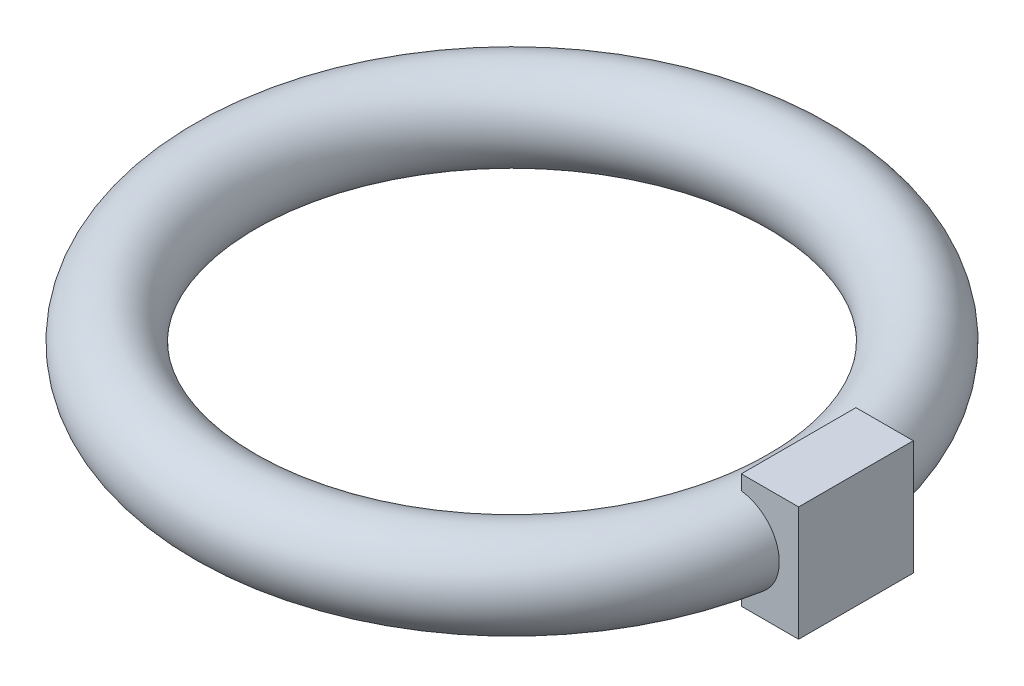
from build123d import *

# Parameters (mm, degrees)
SKETCH1_R           = 7.5
SKETCH4_W           = 20
SKETCH4_H           = 20
BOSS_EXTRUDE1_DEPTH = 10


with BuildPart() as part:
    # Base-Sweep: sweep along a path in Sketch2
    with BuildLine(Plane(origin=(0, 0, 0), x_dir=(1, 0, 0), z_dir=(0, 1, 0))) as base_sweep_path:
        CenterArc((50, 0), 40, 0, 360)
    # Sketch1 → Base-Sweep (sweep)
    with BuildSketch(Plane.XY):
        Circle(SKETCH1_R)
    sweep(path=base_sweep_path.line)

    # Sketch4 → Boss-Extrude1 (add)
    with BuildSketch(Plane(origin=(110, 0, 0), x_dir=(0, 0, -1), z_dir=(1, 0, 0))):
        Rectangle(SKETCH4_W, SKETCH4_H)
    extrude(amount=-BOSS_EXTRUDE1_DEPTH)


solid = part.part
